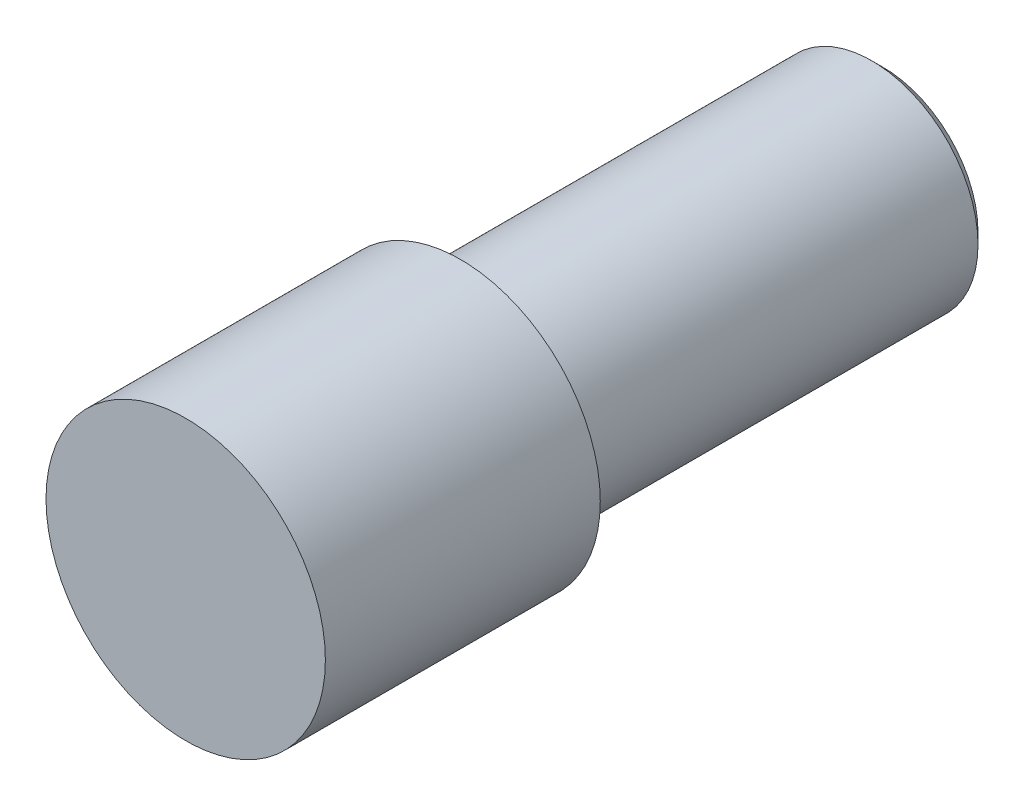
from build123d import *


with BuildPart() as part:
    # Sketch 1 → Revolve 1 (revolve)
    with BuildSketch(Plane(origin=(0, 0, 0), x_dir=(0, 0, -1), z_dir=(1, 0, 0)), mode=Mode.PRIVATE) as revolve_1_sk:
        Polygon((0, 0), (0, 1.5875), (3.1242, 1.5875), (3.1242, 1.2065), (7.7978, 1.2065), (7.9248, 1.0795), (7.9248, 0), align=None)
    revolve(revolve_1_sk.sketch.rotate(Axis((0, 0, 0), (0, 0, -1)), 90), axis=Axis((0, 0, 0), (0, 0, -1)))


solid = part.part
